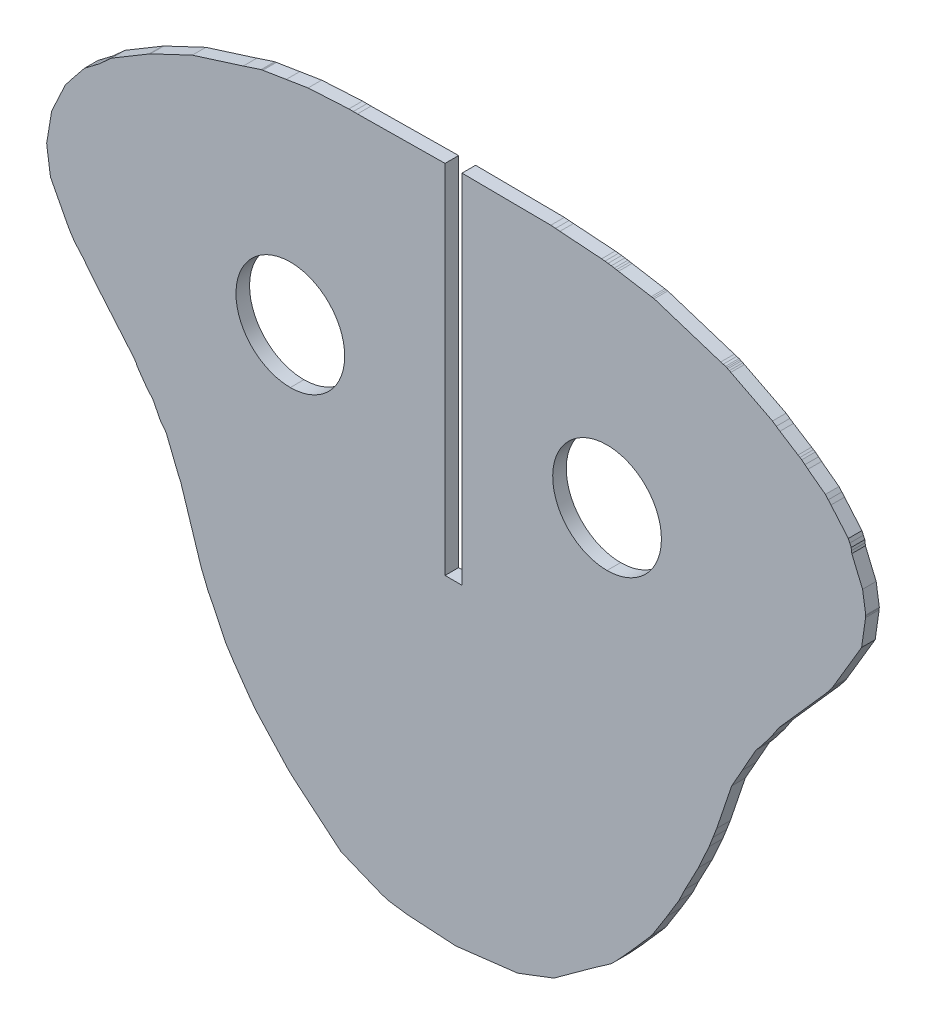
from build123d import *

# Parameters (mm, degrees)
EXTRUDE_1_DEPTH = 2


with BuildPart() as part:
    # Model → Extrude 1 (new body)
    with BuildSketch(Plane.XY):
        Polygon((-4228.3918, -765.8908), (-4227.7464, -765.9433), (-4221.6022, -766.3754), (-4221.1138, -766.4289), (-4220.6578, -766.4789), (-4220.1798, -766.5504), (-4219.7333, -766.6173), (-4219.4218, -766.6754), (-4219.1308, -766.7299), (-4214.2924, -767.5387), (-4214.0734, -767.5724), (-4213.8685, -767.6042), (-4204.0663, -770.7607), (-4203.7112, -770.8678), (-4203.3777, -770.9687), (-4203.2023, -771.0421), (-4203.0374, -771.1115), (-4202.8036, -771.2321), (-4202.5838, -771.3456), (-4196.4529, -774.4787), (-4195.8908, -774.8703), (-4195.3596, -775.2401), (-4192.6938, -776.9335), (-4192.411, -777.1046), (-4192.1429, -777.2665), (-4191.6747, -777.6547), (-4191.2305, -778.0231), (-4188.6674, -779.9355), (-4188.2435, -780.4179), (-4187.8398, -780.8771), (-4185.2854, -783.8681), (-4185.073, -784.3488), (-4184.8697, -784.8092), (-4184.8192, -785.185), (-4184.7709, -785.5453), (-4183.1897, -789.2968), (-4182.7238, -792.3534), (-4182.7305, -792.4281), (-4182.737, -792.5004), (-4182.7465, -792.6867), (-4183.3308, -796.7895), (-4187.5105, -803.8466), (-4187.6112, -804.0138), (-4187.7103, -804.1784), (-4188.6076, -805.3053), (-4195.4706, -813.059), (-4196.6727, -814.8629), (-4198.13, -816.7629), (-4198.9062, -817.6806), (-4200.8898, -821.2216), (-4202.4613, -824.006), (-4204.6601, -830.5229), (-4205.2132, -831.9425), (-4205.7795, -833.3964), (-4207.3495, -836.872), (-4209.3335, -840.644), (-4210.2274, -842.5021), (-4211.9523, -845.3485), (-4214.1377, -848.8188), (-4214.4244, -849.162), (-4214.725, -849.5219), (-4217.6237, -852.8183), (-4219.506, -854.851), (-4219.834, -855.1816), (-4220.1809, -855.5309), (-4220.9488, -856.0722), (-4221.7621, -856.6452), (-4221.9884, -856.7939), (-4222.2284, -856.9518), (-4228.5113, -861.506), (-4228.632, -861.5717), (-4228.7609, -861.6418), (-4233.1522, -863.3234), (-4233.5634, -863.4716), (-4234.0035, -863.63), (-4242.5676, -864.6535), (-4242.7355, -864.672), (-4242.9154, -864.6921), (-4243.0228, -864.6991), (-4243.1307, -864.6996), (-4243.2463, -864.7001), (-4246.6624, -864.4928), (-4250.3232, -864.2712), (-4251.63, -864.079), (-4253.0297, -863.873), (-4253.483, -863.7355), (-4253.9683, -863.5885), (-4259.8354, -861.195), (-4259.8889, -861.173), (-4259.9459, -861.1493), (-4259.9636, -861.1376), (-4259.9825, -861.1252), (-4260.0657, -861.0561), (-4260.1545, -860.9823), (-4266.8943, -855.3258), (-4267.3085, -854.9484), (-4267.7465, -854.5495), (-4268.0569, -854.2118), (-4268.3846, -853.8549), (-4272.4128, -849.4909), (-4273.3473, -848.2685), (-4275.7136, -844.8908), (-4276.9024, -843.0653), (-4278.5817, -839.5512), (-4279.5336, -837.6825), (-4280.5584, -835.1754), (-4283.5931, -825.7138), (-4283.7041, -825.5087), (-4283.8168, -825.3007), (-4285.7033, -820.5907), (-4286.5549, -819.4787), (-4287.6427, -817.3451), (-4288.6038, -816.2145), (-4289.1098, -815.5009), (-4289.9613, -814.2838), (-4290.0612, -814.0544), (-4290.1609, -813.8251), (-4290.4326, -813.4733), (-4290.7037, -813.1225), (-4296.3263, -806.465), (-4297.9647, -804.3778), (-4299.1771, -803.0102), (-4299.8458, -802.007), (-4300.0612, -801.6225), (-4300.2725, -801.2448), (-4302.7076, -796.5754), (-4302.7225, -796.5448), (-4302.737, -796.5153), (-4302.7427, -796.4814), (-4302.7482, -796.4482), (-4303.2784, -792.7004), (-4303.2872, -792.5663), (-4303.2958, -792.4367), (-4303.2623, -792.2614), (-4303.2299, -792.0912), (-4302.5599, -788.0072), (-4300.9384, -784.5229), (-4300.6015, -783.7597), (-4299.6193, -782.4897), (-4297.7258, -780.1413), (-4296.6209, -779.3024), (-4295.5702, -778.5046), (-4294.6397, -777.6679), (-4293.7568, -776.8744), (-4288.2402, -773.5819), (-4288.1721, -773.5402), (-4288.1079, -773.5009), (-4288.0735, -773.4828), (-4288.041, -773.4657), (-4281.8587, -770.5414), (-4274.3558, -768.1733), (-4271.7405, -767.3202), (-4271.6018, -767.297), (-4271.4722, -767.2755), (-4268.0326, -766.7209), (-4264.8195, -766.2023), (-4258.8132, -765.8691), (-4258.158, -765.8747), (-4257.5466, -765.8798), (-4244.6525, -765.7359), (-4244.6525, -818.2719), (-4244.4025, -818.2719), (-4242.4025, -818.2719), (-4242.1525, -818.2719), (-4242.1525, -765.7237), (-4229.0834, -765.8344), align=None)
        with BuildLine():
            add(Edge.make_bspline(
                [(-4220.8047, -805.7065), (-4216.3864, -805.7065), (-4212.8047, -802.1247), (-4212.8047, -797.7065), (-4212.8047, -793.2882), (-4216.3864, -789.7065), (-4220.8047, -789.7065)],
                knots=[0.5, 0.5, 0.5, 0.5, 0.75, 0.75, 0.75, 1, 1, 1, 1], degree=3))
            add(Edge.make_bspline(
                [(-4220.8047, -789.7065), (-4225.223, -789.7065), (-4228.8047, -793.2882), (-4228.8047, -797.7065), (-4228.8047, -802.1247), (-4225.223, -805.7065), (-4220.8047, -805.7065)],
                knots=[0, 0, 0, 0, 0.25, 0.25, 0.25, 0.5, 0.5, 0.5, 0.5], degree=3))
        make_face(mode=Mode.SUBTRACT)
        with BuildLine():
            add(Edge.make_bspline(
                [(-4267.429, -805.7001), (-4263.0107, -805.7001), (-4259.429, -802.1184), (-4259.429, -793.2818), (-4263.0107, -789.7001), (-4267.429, -789.7001)],
                knots=[0.5, 0.5, 0.5, 0.5, 0.75, 0.75, 1, 1, 1, 1], degree=3))
            add(Edge.make_bspline(
                [(-4267.429, -789.7001), (-4271.8473, -789.7001), (-4275.429, -793.2818), (-4275.429, -802.1184), (-4271.8473, -805.7001), (-4267.429, -805.7001)],
                knots=[0, 0, 0, 0, 0.25, 0.25, 0.5, 0.5, 0.5, 0.5], degree=3))
        make_face(mode=Mode.SUBTRACT)
    extrude(amount=EXTRUDE_1_DEPTH)


solid = part.part
